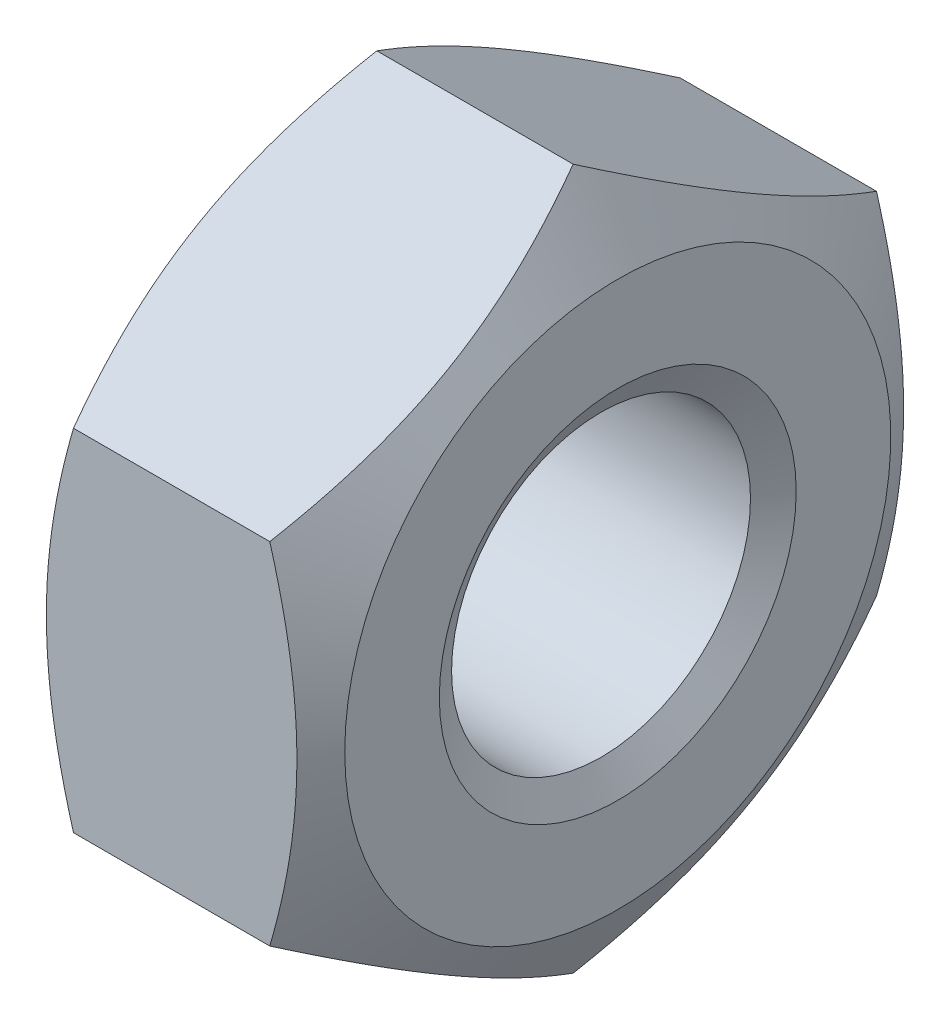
ISO-10303-21;
HEADER;
FILE_DESCRIPTION(('STEP AP214'),'2;1');
FILE_NAME('part.step','',(''),(''),'','','');
FILE_SCHEMA(('AUTOMOTIVE_DESIGN { 1 0 10303 214 1 1 1 1 }'));
ENDSEC;
DATA;
#1=APPLICATION_CONTEXT('core data for automotive mechanical design processes');
#2=APPLICATION_PROTOCOL_DEFINITION('international standard','automotive_design',2000,#1);
#3=PRODUCT_CONTEXT('',#1,'mechanical');
#4=PRODUCT('Part','Part','',(#3));
#5=PRODUCT_RELATED_PRODUCT_CATEGORY('part','',(#4));
#6=PRODUCT_DEFINITION_FORMATION('','',#4);
#7=PRODUCT_DEFINITION_CONTEXT('part definition',#1,'design');
#8=PRODUCT_DEFINITION('design','',#6,#7);
#9=PRODUCT_DEFINITION_SHAPE('','',#8);
#10=(LENGTH_UNIT() NAMED_UNIT(*) SI_UNIT(.MILLI.,.METRE.));
#11=(NAMED_UNIT(*) PLANE_ANGLE_UNIT() SI_UNIT($,.RADIAN.));
#12=(NAMED_UNIT(*) SI_UNIT($,.STERADIAN.) SOLID_ANGLE_UNIT());
#13=UNCERTAINTY_MEASURE_WITH_UNIT(LENGTH_MEASURE(1.E-05),#10,'distance_accuracy_value','');
#14=(GEOMETRIC_REPRESENTATION_CONTEXT(3) GLOBAL_UNCERTAINTY_ASSIGNED_CONTEXT((#13)) GLOBAL_UNIT_ASSIGNED_CONTEXT((#10,
#11,#12)) REPRESENTATION_CONTEXT('',''));
#15=CARTESIAN_POINT('',(0.,0.,0.));
#16=DIRECTION('',(0.,0.,1.));
#17=DIRECTION('',(1.,0.,0.));
#18=AXIS2_PLACEMENT_3D('',#15,#16,#17);
#19=CARTESIAN_POINT('',(0.,-4.90747728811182,8.5));
#20=DIRECTION('',(0.,0.,1.));
#21=DIRECTION('',(1.,0.,0.));
#22=AXIS2_PLACEMENT_3D('',#19,#20,#21);
#23=PLANE('',#22);
#24=CARTESIAN_POINT('',(6.75006285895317,4.90747731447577,8.4999999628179));
#25=CARTESIAN_POINT('',(6.81233002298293,4.69173590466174,8.49999998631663));
#26=CARTESIAN_POINT('',(6.87177104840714,4.47519013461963,8.49999999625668));
#27=CARTESIAN_POINT('',(6.98422246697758,4.04033998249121,8.50000000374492));
#28=CARTESIAN_POINT('',(7.03723008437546,3.82203488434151,8.50000000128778));
#29=CARTESIAN_POINT('',(7.18556219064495,3.16362447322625,8.49999999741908));
#30=CARTESIAN_POINT('',(7.26993039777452,2.72092019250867,8.49999999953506));
#31=CARTESIAN_POINT('',(7.36885998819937,2.05842183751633,8.50000000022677));
#32=CARTESIAN_POINT('',(7.39704175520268,1.84060679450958,8.50000000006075));
#33=CARTESIAN_POINT('',(7.44429680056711,1.40399180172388,8.49999999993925));
#34=CARTESIAN_POINT('',(7.46337088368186,1.18519194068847,8.49999999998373));
#35=CARTESIAN_POINT('',(7.4919271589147,0.747215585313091,8.50000000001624));
#36=CARTESIAN_POINT('',(7.50142023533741,0.52803980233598,8.50000000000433));
#37=CARTESIAN_POINT('',(7.51061098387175,0.0894858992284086,8.49999999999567));
#38=CARTESIAN_POINT('',(7.51030895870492,-0.129892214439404,8.49999999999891));
#39=CARTESIAN_POINT('',(7.50059161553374,-0.540011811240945,8.50000000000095));
#40=CARTESIAN_POINT('',(7.49236167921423,-0.730782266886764,8.50000000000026));
#41=CARTESIAN_POINT('',(7.46865446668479,-1.11187635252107,8.49999999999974));
#42=CARTESIAN_POINT('',(7.45317670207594,-1.30219995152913,8.49999999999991));
#43=CARTESIAN_POINT('',(7.39623745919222,-1.87243388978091,8.50000000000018));
#44=CARTESIAN_POINT('',(7.34427714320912,-2.25133491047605,8.50000000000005));
#45=CARTESIAN_POINT('',(7.214378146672,-3.01315564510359,8.49999999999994));
#46=CARTESIAN_POINT('',(7.13588894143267,-3.39597815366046,8.49999999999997));
#47=CARTESIAN_POINT('',(6.95775190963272,-4.15591496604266,8.50000000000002));
#48=CARTESIAN_POINT('',(6.85814591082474,-4.53303899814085,8.50000000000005));
#49=CARTESIAN_POINT('',(6.75006291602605,-4.90747720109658,8.5));
#50=B_SPLINE_CURVE_WITH_KNOTS('',3,(#24,#25,#26,#27,#28,#29,#30,#31,#32,#33,#34,#35,#36,#37,#38,
#39,#40,#41,#42,#43,#44,#45,#46,#47,#48,#49),.UNSPECIFIED.,.F.,.F.,(4,2,2,2,2,2,2,2,2,2,2,2,4),
(0.,0.673588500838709,1.34746660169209,2.6980222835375,3.35676077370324,4.01544104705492,
4.67337219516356,5.33128300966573,5.90398397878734,6.47672354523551,7.62301827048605,
8.79473231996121,9.96414678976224),.UNSPECIFIED.);
#51=CARTESIAN_POINT('',(6.75006290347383,4.90747730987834,8.49999996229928));
#52=VERTEX_POINT('',#51);
#53=CARTESIAN_POINT('',(6.75006290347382,-4.90747724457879,8.5));
#54=VERTEX_POINT('',#53);
#55=EDGE_CURVE('E91',#52,#54,#50,.T.);
#56=ORIENTED_EDGE('',*,*,#55,.F.);
#57=DIRECTION('',(1.,0.,0.));
#58=VECTOR('',#57,1.);
#59=CARTESIAN_POINT('',(0.,4.90747728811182,8.49999999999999));
#60=LINE('',#59,#58);
#61=CARTESIAN_POINT('',(1.24993709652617,4.90747724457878,8.5));
#62=VERTEX_POINT('',#61);
#63=EDGE_CURVE('E79',#62,#52,#60,.T.);
#64=ORIENTED_EDGE('',*,*,#63,.F.);
#65=CARTESIAN_POINT('',(1.2499370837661,-4.9074772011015,8.50000000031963));
#66=CARTESIAN_POINT('',(1.18766993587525,-4.69173578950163,8.50000000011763));
#67=CARTESIAN_POINT('',(1.12822891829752,-4.47519001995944,8.50000000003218));
#68=CARTESIAN_POINT('',(1.01577750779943,-4.04033987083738,8.49999999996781));
#69=CARTESIAN_POINT('',(0.962769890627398,-3.82203477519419,8.49999999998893));
#70=CARTESIAN_POINT('',(0.814437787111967,-3.16362437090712,8.50000000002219));
#71=CARTESIAN_POINT('',(0.730069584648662,-2.72092009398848,8.500000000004));
#72=CARTESIAN_POINT('',(0.631139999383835,-2.0584217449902,8.49999999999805));
#73=CARTESIAN_POINT('',(0.602958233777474,-1.84060670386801,8.49999999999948));
#74=CARTESIAN_POINT('',(0.555703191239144,-1.40399171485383,8.50000000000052));
#75=CARTESIAN_POINT('',(0.536629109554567,-1.18519185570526,8.50000000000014));
#76=CARTESIAN_POINT('',(0.508072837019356,-0.747215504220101,8.49999999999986));
#77=CARTESIAN_POINT('',(0.498579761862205,-0.528039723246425,8.49999999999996));
#78=CARTESIAN_POINT('',(0.489389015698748,-0.0894858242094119,8.50000000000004));
#79=CARTESIAN_POINT('',(0.489691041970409,0.129892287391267,8.50000000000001));
#80=CARTESIAN_POINT('',(0.499408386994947,0.54001187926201,8.49999999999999));
#81=CARTESIAN_POINT('',(0.507638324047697,0.730782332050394,8.5));
#82=CARTESIAN_POINT('',(0.531345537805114,1.1118764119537,8.5));
#83=CARTESIAN_POINT('',(0.54682330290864,1.30220000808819,8.5));
#84=CARTESIAN_POINT('',(0.603762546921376,1.87243393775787,8.5));
#85=CARTESIAN_POINT('',(0.655722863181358,2.25133495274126,8.5));
#86=CARTESIAN_POINT('',(0.785621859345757,3.01315567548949,8.5));
#87=CARTESIAN_POINT('',(0.864111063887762,3.39597817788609,8.5));
#88=CARTESIAN_POINT('',(1.04224809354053,4.15591497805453,8.5));
#89=CARTESIAN_POINT('',(1.14185409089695,4.53303900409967,8.5));
#90=CARTESIAN_POINT('',(1.24993708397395,4.90747720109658,8.5));
#91=B_SPLINE_CURVE_WITH_KNOTS('',3,(#65,#66,#67,#68,#69,#70,#71,#72,#73,#74,#75,#76,#77,#78,#79,
#80,#81,#82,#83,#84,#85,#86,#87,#88,#89,#90),.UNSPECIFIED.,.F.,.F.,(4,2,2,2,2,2,2,2,2,2,2,2,4),
(0.,0.673588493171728,1.34746658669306,2.69802225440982,3.35676073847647,4.01544100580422,
4.67337214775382,5.33128295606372,5.90398391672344,6.47672347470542,7.62301818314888,
8.79473221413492,9.9641466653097),.UNSPECIFIED.);
#92=CARTESIAN_POINT('',(1.24993711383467,-4.90747727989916,8.50000001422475));
#93=VERTEX_POINT('',#92);
#94=EDGE_CURVE('E115',#93,#62,#91,.T.);
#95=ORIENTED_EDGE('',*,*,#94,.F.);
#96=DIRECTION('',(1.,0.,0.));
#97=VECTOR('',#96,1.);
#98=CARTESIAN_POINT('',(0.,-4.90747728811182,8.5));
#99=LINE('',#98,#97);
#100=EDGE_CURVE('E94',#54,#93,#99,.F.);
#101=ORIENTED_EDGE('',*,*,#100,.F.);
#102=EDGE_LOOP('',(#56,#64,#95,#101));
#103=FACE_BOUND('',#102,.T.);
#104=ADVANCED_FACE('F15',(#103),#23,.T.);
#105=CARTESIAN_POINT('',(0.,4.90747728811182,8.5));
#106=DIRECTION('',(0.,0.866025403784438,0.500000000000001));
#107=DIRECTION('',(0.,-0.500000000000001,0.866025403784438));
#108=AXIS2_PLACEMENT_3D('',#105,#106,#107);
#109=PLANE('',#108);
#110=CARTESIAN_POINT('',(6.75006291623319,9.81495453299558,7.55115455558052E-08));
#111=CARTESIAN_POINT('',(6.81233006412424,9.70708382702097,0.186837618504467));
#112=CARTESIAN_POINT('',(6.87177108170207,9.59881094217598,0.374371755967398));
#113=CARTESIAN_POINT('',(6.98422249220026,9.38138586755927,0.750963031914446));
#114=CARTESIAN_POINT('',(7.03723010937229,9.27223331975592,0.940020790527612));
#115=CARTESIAN_POINT('',(7.18556221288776,8.94302811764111,1.51022092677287));
#116=CARTESIAN_POINT('',(7.26993041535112,8.72167597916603,1.89361407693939));
#117=CARTESIAN_POINT('',(7.36886000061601,8.39042680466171,2.46735447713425));
#118=CARTESIAN_POINT('',(7.39704176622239,8.28151928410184,2.65598783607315));
#119=CARTESIAN_POINT('',(7.44429680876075,8.06321178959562,3.03410750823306));
#120=CARTESIAN_POINT('',(7.46337089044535,7.953811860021,3.22359374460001));
#121=CARTESIAN_POINT('',(7.49192716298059,7.73482368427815,3.60289239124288));
#122=CARTESIAN_POINT('',(7.50142023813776,7.62523579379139,3.79270418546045));
#123=CARTESIAN_POINT('',(7.51061098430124,7.40595884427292,4.17250300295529));
#124=CARTESIAN_POINT('',(7.5103089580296,7.29626978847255,4.36249002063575));
#125=CARTESIAN_POINT('',(7.50059161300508,7.09120999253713,4.71766400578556));
#126=CARTESIAN_POINT('',(7.49236167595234,6.99582476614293,4.88287606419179));
#127=CARTESIAN_POINT('',(7.46865446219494,6.80527772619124,5.21291321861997));
#128=CARTESIAN_POINT('',(7.45317669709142,6.71011592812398,5.37773828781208));
#129=CARTESIAN_POINT('',(7.3962374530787,6.42499896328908,5.87157535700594));
#130=CARTESIAN_POINT('',(7.34427713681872,6.23554845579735,6.19971326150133));
#131=CARTESIAN_POINT('',(7.21437814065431,5.85463809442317,6.85946936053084));
#132=CARTESIAN_POINT('',(7.1358889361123,5.66322684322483,7.19100337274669));
#133=CARTESIAN_POINT('',(6.95775190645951,5.28325844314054,7.84912794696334));
#134=CARTESIAN_POINT('',(6.85814590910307,5.09469643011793,8.17572693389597));
#135=CARTESIAN_POINT('',(6.75006291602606,4.90747733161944,8.49999992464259));
#136=B_SPLINE_CURVE_WITH_KNOTS('',3,(#110,#111,#112,#113,#114,#115,#116,#117,#118,#119,#120,
#121,#122,#123,#124,#125,#126,#127,#128,#129,#130,#131,#132,#133,#134,#135),.UNSPECIFIED.,.F.,
.F.,(4,2,2,2,2,2,2,2,2,2,2,2,4),(0.,0.673588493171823,1.34746658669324,2.69802225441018,
3.3567607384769,4.01544100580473,4.6733721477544,5.33128295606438,5.90398391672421,
6.47672347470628,7.62301818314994,8.79473221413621,9.96414666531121),.UNSPECIFIED.);
#137=CARTESIAN_POINT('',(6.75006288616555,9.81495458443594,1.4224115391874E-08));
#138=VERTEX_POINT('',#137);
#139=EDGE_CURVE('E19',#138,#52,#136,.T.);
#140=ORIENTED_EDGE('',*,*,#139,.F.);
#141=DIRECTION('',(1.,0.,0.));
#142=VECTOR('',#141,1.);
#143=CARTESIAN_POINT('',(0.,9.81495457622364,0.));
#144=LINE('',#143,#142);
#145=CARTESIAN_POINT('',(1.24993709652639,9.81495455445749,3.77000841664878E-08));
#146=VERTEX_POINT('',#145);
#147=EDGE_CURVE('E72',#146,#138,#144,.T.);
#148=ORIENTED_EDGE('',*,*,#147,.F.);
#149=CARTESIAN_POINT('',(1.24993714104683,4.90747724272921,8.5000000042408));
#150=CARTESIAN_POINT('',(1.18766997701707,5.01534796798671,8.31316247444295));
#151=CARTESIAN_POINT('',(1.12822895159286,5.12362086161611,8.12562834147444));
#152=CARTESIAN_POINT('',(1.01577753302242,5.34104594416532,7.74903706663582));
#153=CARTESIAN_POINT('',(0.962769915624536,5.45019849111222,7.55997930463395));
#154=CARTESIAN_POINT('',(0.814437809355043,5.77940369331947,6.98977916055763));
#155=CARTESIAN_POINT('',(0.730069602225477,6.00075583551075,6.60638600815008));
#156=CARTESIAN_POINT('',(0.631140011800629,6.33200501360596,6.03264560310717));
#157=CARTESIAN_POINT('',(0.602958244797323,6.44091253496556,5.84401224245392));
#158=CARTESIAN_POINT('',(0.555703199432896,6.65922003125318,5.46589256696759));
#159=CARTESIAN_POINT('',(0.536629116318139,6.76861996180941,5.27640632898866));
#160=CARTESIAN_POINT('',(0.508072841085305,6.98760813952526,4.89710767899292));
#161=CARTESIAN_POINT('',(0.498579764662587,7.0971960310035,4.70729588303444));
#162=CARTESIAN_POINT('',(0.489389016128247,7.31647298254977,4.32749706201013));
#163=CARTESIAN_POINT('',(0.489691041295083,7.42616203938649,4.13751004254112));
#164=CARTESIAN_POINT('',(0.499408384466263,7.63122183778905,3.78233605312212));
#165=CARTESIAN_POINT('',(0.507638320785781,7.7266070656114,3.61712399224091));
#166=CARTESIAN_POINT('',(0.531345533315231,7.91715410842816,3.28708683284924));
#167=CARTESIAN_POINT('',(0.546823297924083,8.01231590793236,3.12226176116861));
#168=CARTESIAN_POINT('',(0.603762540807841,8.29743287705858,2.62842468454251));
#169=CARTESIAN_POINT('',(0.655722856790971,8.48688338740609,2.3002867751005));
#170=CARTESIAN_POINT('',(0.785621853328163,8.86779375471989,1.64053066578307));
#171=CARTESIAN_POINT('',(0.864111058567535,9.05920500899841,1.30899664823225));
#172=CARTESIAN_POINT('',(1.04224809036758,9.43917341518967,0.650872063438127));
#173=CARTESIAN_POINT('',(1.14185408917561,9.62773543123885,0.324273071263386));
#174=CARTESIAN_POINT('',(1.24993708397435,9.81495453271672,7.5356204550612E-08));
#175=B_SPLINE_CURVE_WITH_KNOTS('',3,(#149,#150,#151,#152,#153,#154,#155,#156,#157,#158,#159,
#160,#161,#162,#163,#164,#165,#166,#167,#168,#169,#170,#171,#172,#173,#174),.UNSPECIFIED.,.F.,
.F.,(4,2,2,2,2,2,2,2,2,2,2,2,4),(0.,0.67358850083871,1.34746660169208,2.6980222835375,
3.35676077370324,4.01544104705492,4.67337219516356,5.33128300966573,5.90398397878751,
6.47672354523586,7.62301827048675,8.79473231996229,9.96414678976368),.UNSPECIFIED.);
#176=EDGE_CURVE('E82',#62,#146,#175,.T.);
#177=ORIENTED_EDGE('',*,*,#176,.F.);
#178=ORIENTED_EDGE('',*,*,#63,.T.);
#179=EDGE_LOOP('',(#140,#148,#177,#178));
#180=FACE_BOUND('',#179,.T.);
#181=ADVANCED_FACE('F81',(#180),#109,.T.);
#182=CARTESIAN_POINT('',(0.,9.81495457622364,0.));
#183=DIRECTION('',(0.,0.866025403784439,-0.499999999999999));
#184=DIRECTION('',(0.,0.499999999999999,0.866025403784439));
#185=AXIS2_PLACEMENT_3D('',#182,#183,#184);
#186=PLANE('',#185);
#187=CARTESIAN_POINT('',(6.75006285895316,4.90747724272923,-8.50000000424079));
#188=CARTESIAN_POINT('',(6.81233002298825,5.01534796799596,-8.31316247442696));
#189=CARTESIAN_POINT('',(6.8717710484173,5.12362086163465,-8.12562834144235));
#190=CARTESIAN_POINT('',(6.98422246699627,5.34104594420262,-7.74903706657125));
#191=CARTESIAN_POINT('',(7.03723008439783,5.45019849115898,-7.55997930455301));
#192=CARTESIAN_POINT('',(7.18556219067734,5.7794036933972,-6.98977916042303));
#193=CARTESIAN_POINT('',(7.26993039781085,6.00075583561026,-6.60638600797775));
#194=CARTESIAN_POINT('',(7.36885998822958,6.33200501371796,-6.0326456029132));
#195=CARTESIAN_POINT('',(7.39704175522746,6.44091253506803,-5.84401224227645));
#196=CARTESIAN_POINT('',(7.44429680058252,6.65922003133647,-5.46589256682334));
#197=CARTESIAN_POINT('',(7.46337088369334,6.76861996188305,-5.27640632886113));
#198=CARTESIAN_POINT('',(7.49192715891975,6.98760813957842,-4.89710767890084));
#199=CARTESIAN_POINT('',(7.50142023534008,7.09719603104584,-4.70729588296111));
#200=CARTESIAN_POINT('',(7.51061098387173,7.31647298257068,-4.32749706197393));
#201=CARTESIAN_POINT('',(7.51030895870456,7.42616203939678,-4.13751004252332));
#202=CARTESIAN_POINT('',(7.50059161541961,7.63122184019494,-3.78233604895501));
#203=CARTESIAN_POINT('',(7.49236167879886,7.72660707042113,-3.61712398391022));
#204=CARTESIAN_POINT('',(7.46865446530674,7.91715411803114,-3.2870868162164));
#205=CARTESIAN_POINT('',(7.45317670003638,8.01231591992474,-3.12226174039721));
#206=CARTESIAN_POINT('',(7.39623745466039,8.29743289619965,-2.62842465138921));
#207=CARTESIAN_POINT('',(7.34427713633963,8.48688341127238,-2.30028673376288));
#208=CARTESIAN_POINT('',(7.21437813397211,8.86779378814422,-1.64053060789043));
#209=CARTESIAN_POINT('',(7.13588892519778,9.05920504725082,-1.30899658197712));
#210=CARTESIAN_POINT('',(6.95775188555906,9.43917346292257,-0.65087198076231));
#211=CARTESIAN_POINT('',(6.85814588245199,9.62773548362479,-0.324272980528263));
#212=CARTESIAN_POINT('',(6.75006288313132,9.81495458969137,2.33267979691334E-08));
#213=B_SPLINE_CURVE_WITH_KNOTS('',3,(#187,#188,#189,#190,#191,#192,#193,#194,#195,#196,#197,
#198,#199,#200,#201,#202,#203,#204,#205,#206,#207,#208,#209,#210,#211,#212),.UNSPECIFIED.,.F.,
.F.,(4,2,2,2,2,2,2,2,2,2,2,2,4),(0.,0.673588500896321,1.34746660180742,2.69802228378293,
3.35676077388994,4.015441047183,4.6733721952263,5.33128300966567,5.90398399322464,
6.47672357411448,7.62301832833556,8.79473240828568,9.96414690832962),.UNSPECIFIED.);
#214=CARTESIAN_POINT('',(6.75006290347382,4.9074772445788,-8.5));
#215=VERTEX_POINT('',#214);
#216=EDGE_CURVE('E93',#215,#138,#213,.T.);
#217=ORIENTED_EDGE('',*,*,#216,.F.);
#218=DIRECTION('',(-1.,0.,0.));
#219=VECTOR('',#218,1.);
#220=CARTESIAN_POINT('',(0.,4.90747728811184,-8.5));
#221=LINE('',#220,#219);
#222=CARTESIAN_POINT('',(1.24993709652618,4.90747730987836,-8.49999996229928));
#223=VERTEX_POINT('',#222);
#224=EDGE_CURVE('E188',#223,#215,#221,.F.);
#225=ORIENTED_EDGE('',*,*,#224,.F.);
#226=CARTESIAN_POINT('',(1.24993714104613,9.81495455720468,4.14214640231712E-08));
#227=CARTESIAN_POINT('',(1.18766997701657,9.7070838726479,-0.186837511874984));
#228=CARTESIAN_POINT('',(1.12822895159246,9.59881099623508,-0.374371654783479));
#229=CARTESIAN_POINT('',(1.01577753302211,9.38138592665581,-0.750962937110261));
#230=CARTESIAN_POINT('',(0.962769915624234,9.27223337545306,-0.940020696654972));
#231=CARTESIAN_POINT('',(0.814437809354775,8.94302816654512,-1.51022083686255));
#232=CARTESIAN_POINT('',(0.730069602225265,8.72167602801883,-1.89361399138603));
#233=CARTESIAN_POINT('',(0.631140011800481,8.39042685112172,-2.46735439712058));
#234=CARTESIAN_POINT('',(0.602958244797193,8.28151932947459,-2.6559877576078));
#235=CARTESIAN_POINT('',(0.5557031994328,8.06321183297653,-3.03410743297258));
#236=CARTESIAN_POINT('',(0.536629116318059,7.95381190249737,-3.22359367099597));
#237=CARTESIAN_POINT('',(0.508072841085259,7.73482372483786,-3.60289232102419));
#238=CARTESIAN_POINT('',(0.498579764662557,7.625235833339,-3.79270411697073));
#239=CARTESIAN_POINT('',(0.489389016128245,7.40595888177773,-4.17250293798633));
#240=CARTESIAN_POINT('',(0.489691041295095,7.29626982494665,-4.36248995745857));
#241=CARTESIAN_POINT('',(0.499408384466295,7.09121002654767,-4.7176639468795));
#242=CARTESIAN_POINT('',(0.50763832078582,6.99582479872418,-4.88287600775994));
#243=CARTESIAN_POINT('',(0.531345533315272,6.80527775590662,-5.21291316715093));
#244=CARTESIAN_POINT('',(0.546823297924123,6.71011595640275,-5.37773823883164));
#245=CARTESIAN_POINT('',(0.603762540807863,6.42499898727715,-5.87157531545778));
#246=CARTESIAN_POINT('',(0.655722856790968,6.23554847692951,-6.1997132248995));
#247=CARTESIAN_POINT('',(0.785621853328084,5.85463810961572,-6.85946933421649));
#248=CARTESIAN_POINT('',(0.864111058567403,5.66322685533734,-7.19100335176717));
#249=CARTESIAN_POINT('',(1.04224809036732,5.28325844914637,-7.84912793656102));
#250=CARTESIAN_POINT('',(1.14185408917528,5.09469643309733,-8.17572692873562));
#251=CARTESIAN_POINT('',(1.24993708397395,4.90747733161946,-8.49999992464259));
#252=B_SPLINE_CURVE_WITH_KNOTS('',3,(#226,#227,#228,#229,#230,#231,#232,#233,#234,#235,#236,
#237,#238,#239,#240,#241,#242,#243,#244,#245,#246,#247,#248,#249,#250,#251),.UNSPECIFIED.,.F.,
.F.,(4,2,2,2,2,2,2,2,2,2,2,2,4),(0.,0.673588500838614,1.3474666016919,2.69802228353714,
3.35676077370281,4.01544104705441,4.67337219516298,5.33128300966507,5.90398397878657,
6.47672354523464,7.62301827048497,8.7947323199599,9.96414678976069),.UNSPECIFIED.);
#253=EDGE_CURVE('E158',#146,#223,#252,.T.);
#254=ORIENTED_EDGE('',*,*,#253,.F.);
#255=ORIENTED_EDGE('',*,*,#147,.T.);
#256=EDGE_LOOP('',(#217,#225,#254,#255));
#257=FACE_BOUND('',#256,.T.);
#258=ADVANCED_FACE('F162',(#257),#186,.T.);
#259=CARTESIAN_POINT('',(0.,4.90747728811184,-8.5));
#260=DIRECTION('',(0.,0.,-1.));
#261=DIRECTION('',(-1.,0.,0.));
#262=AXIS2_PLACEMENT_3D('',#259,#260,#261);
#263=PLANE('',#262);
#264=CARTESIAN_POINT('',(6.75006285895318,-4.90747731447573,-8.49999996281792));
#265=CARTESIAN_POINT('',(6.81233002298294,-4.69173590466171,-8.49999998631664));
#266=CARTESIAN_POINT('',(6.87177104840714,-4.4751901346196,-8.49999999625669));
#267=CARTESIAN_POINT('',(6.98422246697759,-4.04033998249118,-8.50000000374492));
#268=CARTESIAN_POINT('',(7.03723008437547,-3.82203488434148,-8.50000000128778));
#269=CARTESIAN_POINT('',(7.18556219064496,-3.16362447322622,-8.49999999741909));
#270=CARTESIAN_POINT('',(7.26993039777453,-2.72092019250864,-8.49999999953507));
#271=CARTESIAN_POINT('',(7.36885998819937,-2.0584218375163,-8.50000000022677));
#272=CARTESIAN_POINT('',(7.39704175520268,-1.84060679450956,-8.50000000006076));
#273=CARTESIAN_POINT('',(7.44429680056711,-1.40399180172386,-8.49999999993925));
#274=CARTESIAN_POINT('',(7.46337088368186,-1.18519194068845,-8.49999999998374));
#275=CARTESIAN_POINT('',(7.4919271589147,-0.747215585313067,-8.50000000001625));
#276=CARTESIAN_POINT('',(7.50142023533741,-0.528039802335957,-8.50000000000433));
#277=CARTESIAN_POINT('',(7.51061098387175,-0.0894858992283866,-8.49999999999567));
#278=CARTESIAN_POINT('',(7.51030895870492,0.129892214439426,-8.49999999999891));
#279=CARTESIAN_POINT('',(7.50059161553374,0.540011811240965,-8.50000000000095));
#280=CARTESIAN_POINT('',(7.49236167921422,0.730782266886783,-8.50000000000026));
#281=CARTESIAN_POINT('',(7.46865446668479,1.11187635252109,-8.49999999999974));
#282=CARTESIAN_POINT('',(7.45317670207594,1.30219995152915,-8.49999999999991));
#283=CARTESIAN_POINT('',(7.39623745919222,1.87243388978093,-8.50000000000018));
#284=CARTESIAN_POINT('',(7.34427714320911,2.25133491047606,-8.50000000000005));
#285=CARTESIAN_POINT('',(7.21437814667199,3.0131556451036,-8.49999999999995));
#286=CARTESIAN_POINT('',(7.13588894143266,3.39597815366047,-8.49999999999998));
#287=CARTESIAN_POINT('',(6.95775190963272,4.15591496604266,-8.50000000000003));
#288=CARTESIAN_POINT('',(6.85814591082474,4.53303899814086,-8.50000000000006));
#289=CARTESIAN_POINT('',(6.75006291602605,4.90747720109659,-8.5));
#290=B_SPLINE_CURVE_WITH_KNOTS('',3,(#264,#265,#266,#267,#268,#269,#270,#271,#272,#273,#274,
#275,#276,#277,#278,#279,#280,#281,#282,#283,#284,#285,#286,#287,#288,#289),.UNSPECIFIED.,.F.,
.F.,(4,2,2,2,2,2,2,2,2,2,2,2,4),(0.,0.673588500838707,1.34746660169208,2.69802228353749,
3.35676077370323,4.01544104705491,4.67337219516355,5.33128300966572,5.90398397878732,
6.47672354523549,7.62301827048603,8.79473231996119,9.96414678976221),.UNSPECIFIED.);
#291=CARTESIAN_POINT('',(6.75006290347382,-4.90747730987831,-8.49999996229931));
#292=VERTEX_POINT('',#291);
#293=EDGE_CURVE('E173',#292,#215,#290,.T.);
#294=ORIENTED_EDGE('',*,*,#293,.F.);
#295=DIRECTION('',(1.,0.,0.));
#296=VECTOR('',#295,1.);
#297=CARTESIAN_POINT('',(0.,-4.90747728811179,-8.50000000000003));
#298=LINE('',#297,#296);
#299=CARTESIAN_POINT('',(1.24993709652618,-4.90747724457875,-8.50000000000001));
#300=VERTEX_POINT('',#299);
#301=EDGE_CURVE('E186',#300,#292,#298,.T.);
#302=ORIENTED_EDGE('',*,*,#301,.F.);
#303=CARTESIAN_POINT('',(1.24993714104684,4.90747731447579,-8.4999999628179));
#304=CARTESIAN_POINT('',(1.18766997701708,4.69173590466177,-8.49999998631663));
#305=CARTESIAN_POINT('',(1.12822895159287,4.47519013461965,-8.49999999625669));
#306=CARTESIAN_POINT('',(1.01577753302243,4.04033998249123,-8.50000000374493));
#307=CARTESIAN_POINT('',(0.962769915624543,3.82203488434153,-8.50000000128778));
#308=CARTESIAN_POINT('',(0.81443780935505,3.16362447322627,-8.49999999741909));
#309=CARTESIAN_POINT('',(0.730069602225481,2.72092019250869,-8.49999999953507));
#310=CARTESIAN_POINT('',(0.631140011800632,2.05842183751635,-8.50000000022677));
#311=CARTESIAN_POINT('',(0.602958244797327,1.8406067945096,-8.50000000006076));
#312=CARTESIAN_POINT('',(0.555703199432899,1.4039918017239,-8.49999999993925));
#313=CARTESIAN_POINT('',(0.53662911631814,1.18519194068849,-8.49999999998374));
#314=CARTESIAN_POINT('',(0.508072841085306,0.747215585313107,-8.50000000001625));
#315=CARTESIAN_POINT('',(0.498579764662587,0.528039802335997,-8.50000000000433));
#316=CARTESIAN_POINT('',(0.489389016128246,0.0894858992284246,-8.49999999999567));
#317=CARTESIAN_POINT('',(0.489691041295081,-0.129892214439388,-8.49999999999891));
#318=CARTESIAN_POINT('',(0.499408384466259,-0.540011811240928,-8.50000000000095));
#319=CARTESIAN_POINT('',(0.507638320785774,-0.730782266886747,-8.50000000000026));
#320=CARTESIAN_POINT('',(0.53134553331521,-1.11187635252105,-8.49999999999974));
#321=CARTESIAN_POINT('',(0.546823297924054,-1.30219995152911,-8.49999999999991));
#322=CARTESIAN_POINT('',(0.60376254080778,-1.87243388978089,-8.50000000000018));
#323=CARTESIAN_POINT('',(0.655722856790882,-2.25133491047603,-8.50000000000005));
#324=CARTESIAN_POINT('',(0.785621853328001,-3.01315564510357,-8.49999999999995));
#325=CARTESIAN_POINT('',(0.864111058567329,-3.39597815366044,-8.49999999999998));
#326=CARTESIAN_POINT('',(1.04224809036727,-4.15591496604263,-8.50000000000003));
#327=CARTESIAN_POINT('',(1.14185408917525,-4.53303899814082,-8.50000000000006));
#328=CARTESIAN_POINT('',(1.24993708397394,-4.90747720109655,-8.5));
#329=B_SPLINE_CURVE_WITH_KNOTS('',3,(#303,#304,#305,#306,#307,#308,#309,#310,#311,#312,#313,
#314,#315,#316,#317,#318,#319,#320,#321,#322,#323,#324,#325,#326,#327,#328),.UNSPECIFIED.,.F.,
.F.,(4,2,2,2,2,2,2,2,2,2,2,2,4),(0.,0.673588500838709,1.34746660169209,2.6980222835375,
3.35676077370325,4.01544104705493,4.67337219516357,5.33128300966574,5.90398397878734,
6.47672354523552,7.62301827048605,8.79473231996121,9.96414678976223),.UNSPECIFIED.);
#330=EDGE_CURVE('E153',#223,#300,#329,.T.);
#331=ORIENTED_EDGE('',*,*,#330,.F.);
#332=ORIENTED_EDGE('',*,*,#224,.T.);
#333=EDGE_LOOP('',(#294,#302,#331,#332));
#334=FACE_BOUND('',#333,.T.);
#335=ADVANCED_FACE('F165',(#334),#263,.T.);
#336=CARTESIAN_POINT('',(0.,-4.9074772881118,-8.50000000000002));
#337=DIRECTION('',(0.,-0.866025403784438,-0.500000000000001));
#338=DIRECTION('',(0.,0.500000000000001,-0.866025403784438));
#339=AXIS2_PLACEMENT_3D('',#336,#337,#338);
#340=PLANE('',#339);
#341=CARTESIAN_POINT('',(6.75006285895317,-9.81495455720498,4.14228911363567E-08));
#342=CARTESIAN_POINT('',(6.81233002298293,-9.70708387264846,-0.186837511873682));
#343=CARTESIAN_POINT('',(6.87177104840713,-9.59881099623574,-0.374371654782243));
#344=CARTESIAN_POINT('',(6.98422246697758,-9.38138592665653,-0.750962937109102));
#345=CARTESIAN_POINT('',(7.03723008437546,-9.27223337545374,-0.940020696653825));
#346=CARTESIAN_POINT('',(7.18556219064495,-8.94302816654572,-1.51022083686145));
#347=CARTESIAN_POINT('',(7.26993039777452,-8.72167602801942,-1.89361399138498));
#348=CARTESIAN_POINT('',(7.36885998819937,-8.39042685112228,-2.4673543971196));
#349=CARTESIAN_POINT('',(7.39704175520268,-8.28151932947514,-2.65598775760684));
#350=CARTESIAN_POINT('',(7.44429680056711,-8.06321183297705,-3.03410743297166));
#351=CARTESIAN_POINT('',(7.46337088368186,-7.95381190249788,-3.22359367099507));
#352=CARTESIAN_POINT('',(7.4919271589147,-7.73482372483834,-3.60289232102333));
#353=CARTESIAN_POINT('',(7.50142023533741,-7.62523583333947,-3.79270411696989));
#354=CARTESIAN_POINT('',(7.51061098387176,-7.40595888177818,-4.17250293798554));
#355=CARTESIAN_POINT('',(7.51030895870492,-7.29626982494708,-4.36248995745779));
#356=CARTESIAN_POINT('',(7.50059161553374,-7.09121002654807,-4.71766394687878));
#357=CARTESIAN_POINT('',(7.49236167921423,-6.99582479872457,-4.88287600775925));
#358=CARTESIAN_POINT('',(7.46865446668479,-6.80527775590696,-5.2129131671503));
#359=CARTESIAN_POINT('',(7.45317670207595,-6.71011595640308,-5.37773823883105));
#360=CARTESIAN_POINT('',(7.39623745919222,-6.42499898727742,-5.87157531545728));
#361=CARTESIAN_POINT('',(7.34427714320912,-6.23554847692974,-6.19971322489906));
#362=CARTESIAN_POINT('',(7.21437814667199,-5.85463810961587,-6.85946933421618));
#363=CARTESIAN_POINT('',(7.13588894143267,-5.66322685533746,-7.19100335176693));
#364=CARTESIAN_POINT('',(6.95775190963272,-5.28325844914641,-7.84912793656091));
#365=CARTESIAN_POINT('',(6.85814591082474,-5.09469643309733,-8.17572692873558));
#366=CARTESIAN_POINT('',(6.75006291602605,-4.90747733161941,-8.49999992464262));
#367=B_SPLINE_CURVE_WITH_KNOTS('',3,(#341,#342,#343,#344,#345,#346,#347,#348,#349,#350,#351,
#352,#353,#354,#355,#356,#357,#358,#359,#360,#361,#362,#363,#364,#365,#366),.UNSPECIFIED.,.F.,
.F.,(4,2,2,2,2,2,2,2,2,2,2,2,4),(0.,0.673588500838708,1.34746660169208,2.6980222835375,
3.35676077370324,4.01544104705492,4.67337219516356,5.33128300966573,5.90398397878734,
6.47672354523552,7.62301827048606,8.79473231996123,9.96414678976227),.UNSPECIFIED.);
#368=CARTESIAN_POINT('',(6.75006290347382,-9.81495455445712,3.77007178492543E-08));
#369=VERTEX_POINT('',#368);
#370=EDGE_CURVE('E97',#369,#292,#367,.T.);
#371=ORIENTED_EDGE('',*,*,#370,.F.);
#372=DIRECTION('',(1.,0.,0.));
#373=VECTOR('',#372,1.);
#374=CARTESIAN_POINT('',(0.,-9.81495457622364,0.));
#375=LINE('',#374,#373);
#376=CARTESIAN_POINT('',(1.24993709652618,-9.81495455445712,-3.77007229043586E-08));
#377=VERTEX_POINT('',#376);
#378=EDGE_CURVE('E190',#377,#369,#375,.T.);
#379=ORIENTED_EDGE('',*,*,#378,.F.);
#380=CARTESIAN_POINT('',(1.24993714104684,-4.90747724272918,-8.50000000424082));
#381=CARTESIAN_POINT('',(1.18766997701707,-5.01534796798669,-8.31316247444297));
#382=CARTESIAN_POINT('',(1.12822895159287,-5.12362086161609,-8.12562834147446));
#383=CARTESIAN_POINT('',(1.01577753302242,-5.34104594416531,-7.74903706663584));
#384=CARTESIAN_POINT('',(0.962769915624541,-5.45019849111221,-7.55997930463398));
#385=CARTESIAN_POINT('',(0.814437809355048,-5.77940369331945,-6.98977916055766));
#386=CARTESIAN_POINT('',(0.730069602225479,-6.00075583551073,-6.6063860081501));
#387=CARTESIAN_POINT('',(0.63114001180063,-6.33200501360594,-6.03264560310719));
#388=CARTESIAN_POINT('',(0.602958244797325,-6.44091253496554,-5.84401224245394));
#389=CARTESIAN_POINT('',(0.555703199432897,-6.65922003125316,-5.46589256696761));
#390=CARTESIAN_POINT('',(0.536629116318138,-6.76861996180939,-5.27640632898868));
#391=CARTESIAN_POINT('',(0.508072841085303,-6.98760813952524,-4.89710767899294));
#392=CARTESIAN_POINT('',(0.498579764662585,-7.09719603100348,-4.70729588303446));
#393=CARTESIAN_POINT('',(0.489389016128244,-7.31647298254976,-4.32749706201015));
#394=CARTESIAN_POINT('',(0.489691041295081,-7.42616203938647,-4.13751004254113));
#395=CARTESIAN_POINT('',(0.499408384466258,-7.63122183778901,-3.78233605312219));
#396=CARTESIAN_POINT('',(0.507638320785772,-7.72660706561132,-3.61712399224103));
#397=CARTESIAN_POINT('',(0.531345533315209,-7.91715410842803,-3.28708683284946));
#398=CARTESIAN_POINT('',(0.546823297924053,-8.0123159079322,-3.12226176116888));
#399=CARTESIAN_POINT('',(0.60376254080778,-8.29743287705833,-2.62842468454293));
#400=CARTESIAN_POINT('',(0.655722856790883,-8.48688338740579,-2.30028677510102));
#401=CARTESIAN_POINT('',(0.785621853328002,-8.86779375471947,-1.64053066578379));
#402=CARTESIAN_POINT('',(0.86411105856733,-9.05920500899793,-1.30899664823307));
#403=CARTESIAN_POINT('',(1.04224809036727,-9.43917341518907,-0.650872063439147));
#404=CARTESIAN_POINT('',(1.14185408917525,-9.62773543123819,-0.324273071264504));
#405=CARTESIAN_POINT('',(1.24993708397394,-9.81495453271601,-7.53574212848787E-08));
#406=B_SPLINE_CURVE_WITH_KNOTS('',3,(#380,#381,#382,#383,#384,#385,#386,#387,#388,#389,#390,
#391,#392,#393,#394,#395,#396,#397,#398,#399,#400,#401,#402,#403,#404,#405),.UNSPECIFIED.,.F.,
.F.,(4,2,2,2,2,2,2,2,2,2,2,2,4),(0.,0.67358850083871,1.34746660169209,2.6980222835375,
3.35676077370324,4.01544104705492,4.67337219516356,5.33128300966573,5.90398397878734,
6.47672354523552,7.62301827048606,8.79473231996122,9.96414678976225),.UNSPECIFIED.);
#407=EDGE_CURVE('E39',#300,#377,#406,.T.);
#408=ORIENTED_EDGE('',*,*,#407,.F.);
#409=ORIENTED_EDGE('',*,*,#301,.T.);
#410=EDGE_LOOP('',(#371,#379,#408,#409));
#411=FACE_BOUND('',#410,.T.);
#412=ADVANCED_FACE('F169',(#411),#340,.T.);
#413=CARTESIAN_POINT('',(0.,-9.81495457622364,0.));
#414=DIRECTION('',(0.,-0.866025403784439,0.5));
#415=DIRECTION('',(0.,-0.5,-0.866025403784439));
#416=AXIS2_PLACEMENT_3D('',#413,#414,#415);
#417=PLANE('',#416);
#418=CARTESIAN_POINT('',(6.75006285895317,-4.90747724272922,8.5000000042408));
#419=CARTESIAN_POINT('',(6.81233002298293,-5.01534796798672,8.31316247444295));
#420=CARTESIAN_POINT('',(6.87177104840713,-5.12362086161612,8.12562834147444));
#421=CARTESIAN_POINT('',(6.98422246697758,-5.34104594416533,7.74903706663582));
#422=CARTESIAN_POINT('',(7.03723008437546,-5.45019849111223,7.55997930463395));
#423=CARTESIAN_POINT('',(7.18556219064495,-5.77940369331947,6.98977916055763));
#424=CARTESIAN_POINT('',(7.26993039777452,-6.00075583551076,6.60638600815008));
#425=CARTESIAN_POINT('',(7.36885998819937,-6.33200501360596,6.03264560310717));
#426=CARTESIAN_POINT('',(7.39704175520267,-6.44091253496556,5.84401224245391));
#427=CARTESIAN_POINT('',(7.4442968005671,-6.65922003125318,5.46589256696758));
#428=CARTESIAN_POINT('',(7.46337088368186,-6.76861996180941,5.27640632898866));
#429=CARTESIAN_POINT('',(7.4919271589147,-6.98760813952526,4.89710767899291));
#430=CARTESIAN_POINT('',(7.50142023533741,-7.0971960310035,4.70729588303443));
#431=CARTESIAN_POINT('',(7.51061098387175,-7.31647298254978,4.32749706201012));
#432=CARTESIAN_POINT('',(7.51030895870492,-7.4261620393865,4.13751004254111));
#433=CARTESIAN_POINT('',(7.50059161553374,-7.63122183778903,3.78233605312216));
#434=CARTESIAN_POINT('',(7.49236167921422,-7.72660706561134,3.61712399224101));
#435=CARTESIAN_POINT('',(7.46865446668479,-7.91715410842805,3.28708683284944));
#436=CARTESIAN_POINT('',(7.45317670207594,-8.01231590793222,3.12226176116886));
#437=CARTESIAN_POINT('',(7.39623745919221,-8.29743287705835,2.62842468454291));
#438=CARTESIAN_POINT('',(7.34427714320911,-8.4868833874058,2.300286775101));
#439=CARTESIAN_POINT('',(7.21437814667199,-8.86779375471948,1.64053066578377));
#440=CARTESIAN_POINT('',(7.13588894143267,-9.05920500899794,1.30899664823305));
#441=CARTESIAN_POINT('',(6.95775190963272,-9.43917341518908,0.650872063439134));
#442=CARTESIAN_POINT('',(6.85814591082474,-9.6277354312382,0.324273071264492));
#443=CARTESIAN_POINT('',(6.75006291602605,-9.81495453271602,7.53574088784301E-08));
#444=B_SPLINE_CURVE_WITH_KNOTS('',3,(#418,#419,#420,#421,#422,#423,#424,#425,#426,#427,#428,
#429,#430,#431,#432,#433,#434,#435,#436,#437,#438,#439,#440,#441,#442,#443),.UNSPECIFIED.,.F.,
.F.,(4,2,2,2,2,2,2,2,2,2,2,2,4),(0.,0.67358850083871,1.34746660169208,2.6980222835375,
3.35676077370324,4.01544104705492,4.67337219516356,5.33128300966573,5.90398397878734,
6.47672354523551,7.62301827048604,8.7947323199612,9.96414678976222),.UNSPECIFIED.);
#445=EDGE_CURVE('E96',#54,#369,#444,.T.);
#446=ORIENTED_EDGE('',*,*,#445,.F.);
#447=ORIENTED_EDGE('',*,*,#100,.T.);
#448=CARTESIAN_POINT('',(1.24993714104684,-9.81495455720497,-4.14228995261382E-08));
#449=CARTESIAN_POINT('',(1.18766997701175,-9.70708387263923,0.18683751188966));
#450=CARTESIAN_POINT('',(1.1282289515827,-9.59881099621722,0.374371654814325));
#451=CARTESIAN_POINT('',(1.01577753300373,-9.38138592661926,0.750962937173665));
#452=CARTESIAN_POINT('',(0.962769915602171,-9.27223337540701,0.940020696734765));
#453=CARTESIAN_POINT('',(0.814437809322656,-8.94302816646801,1.51022083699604));
#454=CARTESIAN_POINT('',(0.730069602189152,-8.72167602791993,1.89361399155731));
#455=CARTESIAN_POINT('',(0.63114001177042,-8.39042685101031,2.46735439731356));
#456=CARTESIAN_POINT('',(0.602958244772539,-8.28151932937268,2.6559877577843));
#457=CARTESIAN_POINT('',(0.555703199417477,-8.06321183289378,3.0341074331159));
#458=CARTESIAN_POINT('',(0.536629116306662,-7.95381190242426,3.22359367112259));
#459=CARTESIAN_POINT('',(0.508072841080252,-7.73482372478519,3.60289232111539));
#460=CARTESIAN_POINT('',(0.49857976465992,-7.62523583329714,3.79270411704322));
#461=CARTESIAN_POINT('',(0.489389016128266,-7.40595888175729,4.17250293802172));
#462=CARTESIAN_POINT('',(0.489691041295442,-7.29626982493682,4.36248995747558));
#463=CARTESIAN_POINT('',(0.499408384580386,-7.09121002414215,4.71766395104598));
#464=CARTESIAN_POINT('',(0.507638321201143,-6.99582479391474,4.88287601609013));
#465=CARTESIAN_POINT('',(0.531345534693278,-6.80527774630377,5.21291318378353));
#466=CARTESIAN_POINT('',(0.546823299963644,-6.71011594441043,5.37773825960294));
#467=CARTESIAN_POINT('',(0.60376254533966,-6.42499896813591,5.87157534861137));
#468=CARTESIAN_POINT('',(0.655722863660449,-6.23554845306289,6.19971326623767));
#469=CARTESIAN_POINT('',(0.78562186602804,-5.85463807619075,6.85946939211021));
#470=CARTESIAN_POINT('',(0.864111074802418,-5.66322681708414,7.19100341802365));
#471=CARTESIAN_POINT('',(1.04224811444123,-5.28325840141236,7.84912801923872));
#472=CARTESIAN_POINT('',(1.14185411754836,-5.09469638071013,8.17572701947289));
#473=CARTESIAN_POINT('',(1.24993711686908,-4.9074772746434,8.500000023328));
#474=B_SPLINE_CURVE_WITH_KNOTS('',3,(#448,#449,#450,#451,#452,#453,#454,#455,#456,#457,#458,
#459,#460,#461,#462,#463,#464,#465,#466,#467,#468,#469,#470,#471,#472,#473),.UNSPECIFIED.,.F.,
.F.,(4,2,2,2,2,2,2,2,2,2,2,2,4),(0.,0.673588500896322,1.34746660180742,2.69802228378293,
3.35676077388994,4.015441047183,4.6733721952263,5.33128300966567,5.90398399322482,
6.47672357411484,7.62301832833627,8.79473240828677,9.96414690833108),.UNSPECIFIED.);
#475=EDGE_CURVE('E141',#377,#93,#474,.T.);
#476=ORIENTED_EDGE('',*,*,#475,.F.);
#477=ORIENTED_EDGE('',*,*,#378,.T.);
#478=EDGE_LOOP('',(#446,#447,#476,#477));
#479=FACE_BOUND('',#478,.T.);
#480=ADVANCED_FACE('F209',(#479),#417,.T.);
#481=CARTESIAN_POINT('',(6.74256326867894,0.,0.));
#482=DIRECTION('',(-1.,0.,0.));
#483=DIRECTION('',(0.,0.,1.));
#484=AXIS2_PLACEMENT_3D('',#481,#482,#483);
#485=CONICAL_SURFACE('',#484,9.82794430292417,1.04719755);
#486=CARTESIAN_POINT('',(8.00000000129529,0.,0.));
#487=DIRECTION('',(-1.,0.,0.));
#488=DIRECTION('',(0.,0.,1.));
#489=AXIS2_PLACEMENT_3D('',#486,#487,#488);
#490=CIRCLE('',#489,7.65000000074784);
#491=CARTESIAN_POINT('',(8.00000000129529,0.,7.65000000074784));
#492=VERTEX_POINT('',#491);
#493=EDGE_CURVE('E203',#492,#492,#490,.F.);
#494=ORIENTED_EDGE('',*,*,#493,.F.);
#495=EDGE_LOOP('',(#494));
#496=FACE_BOUND('',#495,.T.);
#497=ORIENTED_EDGE('',*,*,#293,.T.);
#498=ORIENTED_EDGE('',*,*,#216,.T.);
#499=ORIENTED_EDGE('',*,*,#139,.T.);
#500=ORIENTED_EDGE('',*,*,#55,.T.);
#501=ORIENTED_EDGE('',*,*,#445,.T.);
#502=ORIENTED_EDGE('',*,*,#370,.T.);
#503=EDGE_LOOP('',(#497,#498,#499,#500,#501,#502));
#504=FACE_BOUND('',#503,.T.);
#505=ADVANCED_FACE('F89',(#496,#504),#485,.T.);
#506=CARTESIAN_POINT('',(1.25743673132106,0.,0.));
#507=DIRECTION('',(1.,0.,0.));
#508=DIRECTION('',(0.,0.,-1.));
#509=AXIS2_PLACEMENT_3D('',#506,#507,#508);
#510=CONICAL_SURFACE('',#509,9.82794430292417,1.04719755);
#511=CARTESIAN_POINT('',(-1.29528939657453E-09,0.,0.));
#512=DIRECTION('',(1.,0.,0.));
#513=DIRECTION('',(0.,0.,-1.));
#514=AXIS2_PLACEMENT_3D('',#511,#512,#513);
#515=CIRCLE('',#514,7.65000000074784);
#516=CARTESIAN_POINT('',(-1.29528939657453E-09,0.,-7.65000000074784));
#517=VERTEX_POINT('',#516);
#518=EDGE_CURVE('E201',#517,#517,#515,.T.);
#519=ORIENTED_EDGE('',*,*,#518,.T.);
#520=EDGE_LOOP('',(#519));
#521=FACE_BOUND('',#520,.T.);
#522=ORIENTED_EDGE('',*,*,#407,.T.);
#523=ORIENTED_EDGE('',*,*,#475,.T.);
#524=ORIENTED_EDGE('',*,*,#94,.T.);
#525=ORIENTED_EDGE('',*,*,#176,.T.);
#526=ORIENTED_EDGE('',*,*,#253,.T.);
#527=ORIENTED_EDGE('',*,*,#330,.T.);
#528=EDGE_LOOP('',(#522,#523,#524,#525,#526,#527));
#529=FACE_BOUND('',#528,.T.);
#530=ADVANCED_FACE('F129',(#521,#529),#510,.T.);
#531=CARTESIAN_POINT('',(8.,0.,0.));
#532=DIRECTION('',(1.,0.,0.));
#533=DIRECTION('',(0.,0.,-1.));
#534=AXIS2_PLACEMENT_3D('',#531,#532,#533);
#535=PLANE('',#534);
#536=CARTESIAN_POINT('',(8.00000000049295,0.,0.));
#537=DIRECTION('',(1.,0.,0.));
#538=DIRECTION('',(0.,0.,-1.));
#539=AXIS2_PLACEMENT_3D('',#536,#537,#538);
#540=CIRCLE('',#539,4.99989881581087);
#541=CARTESIAN_POINT('',(8.00000000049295,0.,-4.99989881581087));
#542=VERTEX_POINT('',#541);
#543=EDGE_CURVE('E198',#542,#542,#540,.F.);
#544=ORIENTED_EDGE('',*,*,#543,.T.);
#545=EDGE_LOOP('',(#544));
#546=FACE_BOUND('',#545,.T.);
#547=ORIENTED_EDGE('',*,*,#493,.T.);
#548=EDGE_LOOP('',(#547));
#549=FACE_BOUND('',#548,.T.);
#550=ADVANCED_FACE('F133',(#546,#549),#535,.T.);
#551=CARTESIAN_POINT('',(0.,0.,0.));
#552=DIRECTION('',(1.,0.,0.));
#553=DIRECTION('',(0.,0.,-1.));
#554=AXIS2_PLACEMENT_3D('',#551,#552,#553);
#555=PLANE('',#554);
#556=CARTESIAN_POINT('',(-5.20384477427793E-10,0.,0.));
#557=DIRECTION('',(-1.,0.,0.));
#558=DIRECTION('',(0.,0.,1.));
#559=AXIS2_PLACEMENT_3D('',#556,#557,#558);
#560=CIRCLE('',#559,4.99989881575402);
#561=CARTESIAN_POINT('',(-5.20384477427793E-10,0.,4.99989881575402));
#562=VERTEX_POINT('',#561);
#563=EDGE_CURVE('E195',#562,#562,#560,.F.);
#564=ORIENTED_EDGE('',*,*,#563,.T.);
#565=EDGE_LOOP('',(#564));
#566=FACE_BOUND('',#565,.T.);
#567=ORIENTED_EDGE('',*,*,#518,.F.);
#568=EDGE_LOOP('',(#567));
#569=FACE_BOUND('',#568,.T.);
#570=ADVANCED_FACE('F235',(#566,#569),#555,.F.);
#571=CARTESIAN_POINT('',(8.00000000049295,0.,0.));
#572=DIRECTION('',(1.,0.,0.));
#573=DIRECTION('',(0.,0.,-1.));
#574=AXIS2_PLACEMENT_3D('',#571,#572,#573);
#575=CONICAL_SURFACE('',#574,4.99989881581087,1.04719754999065);
#576=ORIENTED_EDGE('',*,*,#543,.F.);
#577=EDGE_LOOP('',(#576));
#578=FACE_BOUND('',#577,.T.);
#579=CARTESIAN_POINT('',(7.53125,0.,0.));
#580=DIRECTION('',(-1.,0.,0.));
#581=DIRECTION('',(0.,0.,1.));
#582=AXIS2_PLACEMENT_3D('',#579,#580,#581);
#583=CIRCLE('',#582,4.188);
#584=CARTESIAN_POINT('',(7.53125,0.,4.188));
#585=VERTEX_POINT('',#584);
#586=EDGE_CURVE('E30',#585,#585,#583,.T.);
#587=ORIENTED_EDGE('',*,*,#586,.T.);
#588=EDGE_LOOP('',(#587));
#589=FACE_BOUND('',#588,.T.);
#590=ADVANCED_FACE('F219',(#578,#589),#575,.F.);
#591=CARTESIAN_POINT('',(-4.54747350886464E-10,0.,0.));
#592=DIRECTION('',(-1.,0.,0.));
#593=DIRECTION('',(0.,0.,1.));
#594=AXIS2_PLACEMENT_3D('',#591,#592,#593);
#595=CONICAL_SURFACE('',#594,4.99989881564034,1.04719755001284);
#596=ORIENTED_EDGE('',*,*,#563,.F.);
#597=EDGE_LOOP('',(#596));
#598=FACE_BOUND('',#597,.T.);
#599=CARTESIAN_POINT('',(0.46875,0.,0.));
#600=DIRECTION('',(1.,0.,0.));
#601=DIRECTION('',(0.,0.,-1.));
#602=AXIS2_PLACEMENT_3D('',#599,#600,#601);
#603=CIRCLE('',#602,4.188);
#604=CARTESIAN_POINT('',(0.46875,0.,-4.188));
#605=VERTEX_POINT('',#604);
#606=EDGE_CURVE('E10',#605,#605,#603,.T.);
#607=ORIENTED_EDGE('',*,*,#606,.T.);
#608=EDGE_LOOP('',(#607));
#609=FACE_BOUND('',#608,.T.);
#610=ADVANCED_FACE('F222',(#598,#609),#595,.F.);
#611=CARTESIAN_POINT('',(7.53125,0.,0.));
#612=DIRECTION('',(-1.,0.,0.));
#613=DIRECTION('',(0.,0.,1.));
#614=AXIS2_PLACEMENT_3D('',#611,#612,#613);
#615=CYLINDRICAL_SURFACE('',#614,4.188);
#616=ORIENTED_EDGE('',*,*,#606,.F.);
#617=EDGE_LOOP('',(#616));
#618=FACE_BOUND('',#617,.T.);
#619=ORIENTED_EDGE('',*,*,#586,.F.);
#620=EDGE_LOOP('',(#619));
#621=FACE_BOUND('',#620,.T.);
#622=ADVANCED_FACE('F17',(#618,#621),#615,.F.);
#623=CLOSED_SHELL('',(#104,#181,#258,#335,#412,#480,#505,#530,#550,#570,#590,#610,#622));
#624=MANIFOLD_SOLID_BREP('B1',#623);
#625=ADVANCED_BREP_SHAPE_REPRESENTATION('',(#18,#624),#14);
#626=SHAPE_DEFINITION_REPRESENTATION(#9,#625);
ENDSEC;
END-ISO-10303-21;
